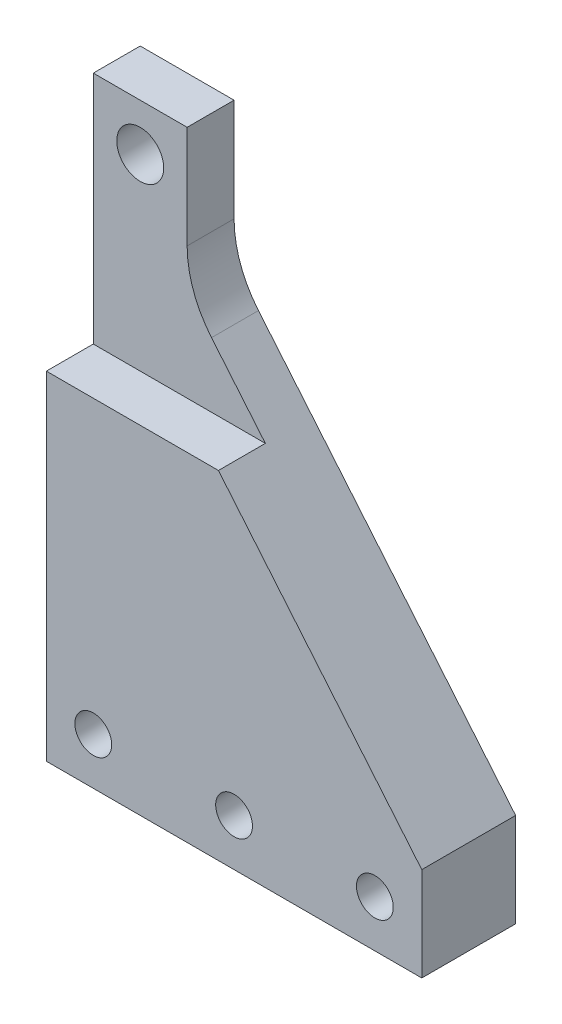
ISO-10303-21;
HEADER;
FILE_DESCRIPTION(('STEP AP214'),'2;1');
FILE_NAME('part.step','',(''),(''),'','','');
FILE_SCHEMA(('AUTOMOTIVE_DESIGN { 1 0 10303 214 1 1 1 1 }'));
ENDSEC;
DATA;
#1=APPLICATION_CONTEXT('core data for automotive mechanical design processes');
#2=APPLICATION_PROTOCOL_DEFINITION('international standard','automotive_design',2000,#1);
#3=PRODUCT_CONTEXT('',#1,'mechanical');
#4=PRODUCT('Part','Part','',(#3));
#5=PRODUCT_RELATED_PRODUCT_CATEGORY('part','',(#4));
#6=PRODUCT_DEFINITION_FORMATION('','',#4);
#7=PRODUCT_DEFINITION_CONTEXT('part definition',#1,'design');
#8=PRODUCT_DEFINITION('design','',#6,#7);
#9=PRODUCT_DEFINITION_SHAPE('','',#8);
#10=(LENGTH_UNIT() NAMED_UNIT(*) SI_UNIT(.MILLI.,.METRE.));
#11=(NAMED_UNIT(*) PLANE_ANGLE_UNIT() SI_UNIT($,.RADIAN.));
#12=(NAMED_UNIT(*) SI_UNIT($,.STERADIAN.) SOLID_ANGLE_UNIT());
#13=UNCERTAINTY_MEASURE_WITH_UNIT(LENGTH_MEASURE(1.E-05),#10,'distance_accuracy_value','');
#14=(GEOMETRIC_REPRESENTATION_CONTEXT(3) GLOBAL_UNCERTAINTY_ASSIGNED_CONTEXT((#13)) GLOBAL_UNIT_ASSIGNED_CONTEXT((#10,
#11,#12)) REPRESENTATION_CONTEXT('',''));
#15=CARTESIAN_POINT('',(0.,0.,0.));
#16=DIRECTION('',(0.,0.,1.));
#17=DIRECTION('',(1.,0.,0.));
#18=AXIS2_PLACEMENT_3D('',#15,#16,#17);
#19=CARTESIAN_POINT('',(-6.35,71.12,-12.7));
#20=DIRECTION('',(0.,-1.,0.));
#21=DIRECTION('',(0.,0.,1.));
#22=AXIS2_PLACEMENT_3D('',#19,#20,#21);
#23=PLANE('',#22);
#24=DIRECTION('',(1.,0.,0.));
#25=VECTOR('',#24,1.);
#26=CARTESIAN_POINT('',(0.,71.12,-6.35));
#27=LINE('',#26,#25);
#28=CARTESIAN_POINT('',(-6.35,71.12,-6.35));
#29=VERTEX_POINT('',#28);
#30=CARTESIAN_POINT('',(6.35,71.12,-6.35));
#31=VERTEX_POINT('',#30);
#32=EDGE_CURVE('E122',#29,#31,#27,.T.);
#33=ORIENTED_EDGE('',*,*,#32,.T.);
#34=DIRECTION('',(0.,0.,-1.));
#35=VECTOR('',#34,1.);
#36=CARTESIAN_POINT('',(6.35,71.12,0.));
#37=LINE('',#36,#35);
#38=CARTESIAN_POINT('',(6.35,71.12,-12.7));
#39=VERTEX_POINT('',#38);
#40=EDGE_CURVE('E150',#31,#39,#37,.T.);
#41=ORIENTED_EDGE('',*,*,#40,.T.);
#42=DIRECTION('',(-1.,0.,0.));
#43=VECTOR('',#42,1.);
#44=CARTESIAN_POINT('',(-6.35,71.12,-12.7));
#45=LINE('',#44,#43);
#46=CARTESIAN_POINT('',(-6.35,71.12,-12.7));
#47=VERTEX_POINT('',#46);
#48=EDGE_CURVE('E186',#39,#47,#45,.T.);
#49=ORIENTED_EDGE('',*,*,#48,.T.);
#50=DIRECTION('',(0.,0.,1.));
#51=VECTOR('',#50,1.);
#52=CARTESIAN_POINT('',(-6.35,71.12,-12.7));
#53=LINE('',#52,#51);
#54=EDGE_CURVE('E189',#47,#29,#53,.T.);
#55=ORIENTED_EDGE('',*,*,#54,.T.);
#56=EDGE_LOOP('',(#33,#41,#49,#55));
#57=FACE_BOUND('',#56,.T.);
#58=ADVANCED_FACE('F37',(#57),#23,.F.);
#59=CARTESIAN_POINT('',(0.,64.77,-12.7));
#60=DIRECTION('',(0.,0.,1.));
#61=DIRECTION('',(-1.,0.,0.));
#62=AXIS2_PLACEMENT_3D('',#59,#60,#61);
#63=CYLINDRICAL_SURFACE('',#62,3.175);
#64=CARTESIAN_POINT('',(0.,64.77,-12.7));
#65=DIRECTION('',(0.,0.,1.));
#66=DIRECTION('',(1.,0.,0.));
#67=AXIS2_PLACEMENT_3D('',#64,#65,#66);
#68=CIRCLE('',#67,3.175);
#69=CARTESIAN_POINT('',(3.175,64.77,-12.7));
#70=VERTEX_POINT('',#69);
#71=EDGE_CURVE('E153',#70,#70,#68,.T.);
#72=ORIENTED_EDGE('',*,*,#71,.F.);
#73=EDGE_LOOP('',(#72));
#74=FACE_BOUND('',#73,.T.);
#75=CARTESIAN_POINT('',(0.,64.77,-6.35));
#76=DIRECTION('',(0.,0.,-1.));
#77=DIRECTION('',(-1.,0.,0.));
#78=AXIS2_PLACEMENT_3D('',#75,#76,#77);
#79=CIRCLE('',#78,3.175);
#80=CARTESIAN_POINT('',(-3.175,64.77,-6.35));
#81=VERTEX_POINT('',#80);
#82=EDGE_CURVE('E137',#81,#81,#79,.T.);
#83=ORIENTED_EDGE('',*,*,#82,.F.);
#84=EDGE_LOOP('',(#83));
#85=FACE_BOUND('',#84,.T.);
#86=ADVANCED_FACE('F237',(#74,#85),#63,.F.);
#87=CARTESIAN_POINT('',(6.35,52.07,0.));
#88=DIRECTION('',(-1.,0.,0.));
#89=DIRECTION('',(0.,0.,-1.));
#90=AXIS2_PLACEMENT_3D('',#87,#88,#89);
#91=PLANE('',#90);
#92=DIRECTION('',(0.,-1.,0.));
#93=VECTOR('',#92,1.);
#94=CARTESIAN_POINT('',(6.35,52.07,-12.7));
#95=LINE('',#94,#93);
#96=CARTESIAN_POINT('',(6.35,57.2197982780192,-12.7));
#97=VERTEX_POINT('',#96);
#98=EDGE_CURVE('E141',#39,#97,#95,.T.);
#99=ORIENTED_EDGE('',*,*,#98,.F.);
#100=ORIENTED_EDGE('',*,*,#40,.F.);
#101=DIRECTION('',(0.,-1.,0.));
#102=VECTOR('',#101,1.);
#103=CARTESIAN_POINT('',(6.35,0.,-6.35));
#104=LINE('',#103,#102);
#105=CARTESIAN_POINT('',(6.35,57.2197982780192,-6.35));
#106=VERTEX_POINT('',#105);
#107=EDGE_CURVE('E128',#31,#106,#104,.T.);
#108=ORIENTED_EDGE('',*,*,#107,.T.);
#109=DIRECTION('',(0.,0.,-1.));
#110=VECTOR('',#109,1.);
#111=CARTESIAN_POINT('',(6.35,57.2197982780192,-6.35));
#112=LINE('',#111,#110);
#113=EDGE_CURVE('E204',#97,#106,#112,.F.);
#114=ORIENTED_EDGE('',*,*,#113,.F.);
#115=EDGE_LOOP('',(#99,#100,#108,#114));
#116=FACE_BOUND('',#115,.T.);
#117=ADVANCED_FACE('F207',(#116),#91,.F.);
#118=CARTESIAN_POINT('',(0.,0.,-12.7));
#119=DIRECTION('',(0.,0.,1.));
#120=DIRECTION('',(-1.,0.,0.));
#121=AXIS2_PLACEMENT_3D('',#118,#119,#120);
#122=PLANE('',#121);
#123=DIRECTION('',(0.64018439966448,-0.768221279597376,0.));
#124=VECTOR('',#123,1.);
#125=CARTESIAN_POINT('',(44.45,6.35,-12.7));
#126=LINE('',#125,#124);
#127=CARTESIAN_POINT('',(9.64682051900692,48.1138153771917,-12.7));
#128=VERTEX_POINT('',#127);
#129=CARTESIAN_POINT('',(44.45,6.35,-12.7));
#130=VERTEX_POINT('',#129);
#131=EDGE_CURVE('E145',#128,#130,#126,.T.);
#132=ORIENTED_EDGE('',*,*,#131,.T.);
#133=DIRECTION('',(0.,1.,0.));
#134=VECTOR('',#133,1.);
#135=CARTESIAN_POINT('',(44.45,-6.35,-12.7));
#136=LINE('',#135,#134);
#137=CARTESIAN_POINT('',(44.45,-6.35,-12.7));
#138=VERTEX_POINT('',#137);
#139=EDGE_CURVE('E183',#138,#130,#136,.T.);
#140=ORIENTED_EDGE('',*,*,#139,.F.);
#141=DIRECTION('',(1.,0.,0.));
#142=VECTOR('',#141,1.);
#143=CARTESIAN_POINT('',(-6.35,-6.35,-12.7));
#144=LINE('',#143,#142);
#145=CARTESIAN_POINT('',(-6.35,-6.35,-12.7));
#146=VERTEX_POINT('',#145);
#147=EDGE_CURVE('E179',#146,#138,#144,.T.);
#148=ORIENTED_EDGE('',*,*,#147,.F.);
#149=DIRECTION('',(0.,-1.,0.));
#150=VECTOR('',#149,1.);
#151=CARTESIAN_POINT('',(-6.35,-6.35,-12.7));
#152=LINE('',#151,#150);
#153=EDGE_CURVE('E176',#47,#146,#152,.T.);
#154=ORIENTED_EDGE('',*,*,#153,.F.);
#155=ORIENTED_EDGE('',*,*,#48,.F.);
#156=ORIENTED_EDGE('',*,*,#98,.T.);
#157=CARTESIAN_POINT('',(20.574,57.2197982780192,-12.7));
#158=DIRECTION('',(0.,0.,-1.));
#159=DIRECTION('',(-1.,0.,0.));
#160=AXIS2_PLACEMENT_3D('',#157,#158,#159);
#161=CIRCLE('',#160,14.224);
#162=EDGE_CURVE('E45',#128,#97,#161,.T.);
#163=ORIENTED_EDGE('',*,*,#162,.F.);
#164=EDGE_LOOP('',(#132,#140,#148,#154,#155,#156,#163));
#165=FACE_BOUND('',#164,.T.);
#166=CARTESIAN_POINT('',(0.,0.,-12.7));
#167=DIRECTION('',(0.,0.,1.));
#168=DIRECTION('',(1.,0.,0.));
#169=AXIS2_PLACEMENT_3D('',#166,#167,#168);
#170=CIRCLE('',#169,2.4892);
#171=CARTESIAN_POINT('',(2.4892,0.,-12.7));
#172=VERTEX_POINT('',#171);
#173=EDGE_CURVE('E170',#172,#172,#170,.T.);
#174=ORIENTED_EDGE('',*,*,#173,.T.);
#175=EDGE_LOOP('',(#174));
#176=FACE_BOUND('',#175,.T.);
#177=CARTESIAN_POINT('',(38.1,0.,-12.7));
#178=DIRECTION('',(0.,0.,1.));
#179=DIRECTION('',(1.,0.,0.));
#180=AXIS2_PLACEMENT_3D('',#177,#178,#179);
#181=CIRCLE('',#180,2.4892);
#182=CARTESIAN_POINT('',(40.5892,0.,-12.7));
#183=VERTEX_POINT('',#182);
#184=EDGE_CURVE('E164',#183,#183,#181,.T.);
#185=ORIENTED_EDGE('',*,*,#184,.T.);
#186=EDGE_LOOP('',(#185));
#187=FACE_BOUND('',#186,.T.);
#188=CARTESIAN_POINT('',(19.05,0.,-12.7));
#189=DIRECTION('',(0.,0.,1.));
#190=DIRECTION('',(1.,0.,0.));
#191=AXIS2_PLACEMENT_3D('',#188,#189,#190);
#192=CIRCLE('',#191,2.4892);
#193=CARTESIAN_POINT('',(21.5392,0.,-12.7));
#194=VERTEX_POINT('',#193);
#195=EDGE_CURVE('E158',#194,#194,#192,.T.);
#196=ORIENTED_EDGE('',*,*,#195,.T.);
#197=EDGE_LOOP('',(#196));
#198=FACE_BOUND('',#197,.T.);
#199=ORIENTED_EDGE('',*,*,#71,.T.);
#200=EDGE_LOOP('',(#199));
#201=FACE_BOUND('',#200,.T.);
#202=ADVANCED_FACE('F224',(#165,#176,#187,#198,#201),#122,.F.);
#203=CARTESIAN_POINT('',(0.,0.,0.));
#204=DIRECTION('',(0.,0.,1.));
#205=DIRECTION('',(-1.,0.,0.));
#206=AXIS2_PLACEMENT_3D('',#203,#204,#205);
#207=PLANE('',#206);
#208=DIRECTION('',(-1.,0.,0.));
#209=VECTOR('',#208,1.);
#210=CARTESIAN_POINT('',(0.,39.37,0.));
#211=LINE('',#210,#209);
#212=CARTESIAN_POINT('',(16.9333333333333,39.37,0.));
#213=VERTEX_POINT('',#212);
#214=CARTESIAN_POINT('',(-6.35,39.37,0.));
#215=VERTEX_POINT('',#214);
#216=EDGE_CURVE('E117',#213,#215,#211,.T.);
#217=ORIENTED_EDGE('',*,*,#216,.T.);
#218=DIRECTION('',(0.,-1.,0.));
#219=VECTOR('',#218,1.);
#220=CARTESIAN_POINT('',(-6.35,-6.35,0.));
#221=LINE('',#220,#219);
#222=CARTESIAN_POINT('',(-6.35,-6.35,0.));
#223=VERTEX_POINT('',#222);
#224=EDGE_CURVE('E173',#215,#223,#221,.T.);
#225=ORIENTED_EDGE('',*,*,#224,.T.);
#226=DIRECTION('',(1.,0.,0.));
#227=VECTOR('',#226,1.);
#228=CARTESIAN_POINT('',(-6.35,-6.35,0.));
#229=LINE('',#228,#227);
#230=CARTESIAN_POINT('',(44.45,-6.35,0.));
#231=VERTEX_POINT('',#230);
#232=EDGE_CURVE('E192',#223,#231,#229,.T.);
#233=ORIENTED_EDGE('',*,*,#232,.T.);
#234=DIRECTION('',(0.,1.,0.));
#235=VECTOR('',#234,1.);
#236=CARTESIAN_POINT('',(44.45,-6.35,0.));
#237=LINE('',#236,#235);
#238=CARTESIAN_POINT('',(44.45,6.35,0.));
#239=VERTEX_POINT('',#238);
#240=EDGE_CURVE('E180',#231,#239,#237,.T.);
#241=ORIENTED_EDGE('',*,*,#240,.T.);
#242=DIRECTION('',(0.64018439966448,-0.768221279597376,0.));
#243=VECTOR('',#242,1.);
#244=CARTESIAN_POINT('',(44.45,6.35,0.));
#245=LINE('',#244,#243);
#246=EDGE_CURVE('E142',#213,#239,#245,.T.);
#247=ORIENTED_EDGE('',*,*,#246,.F.);
#248=EDGE_LOOP('',(#217,#225,#233,#241,#247));
#249=FACE_BOUND('',#248,.T.);
#250=CARTESIAN_POINT('',(19.05,0.,0.));
#251=DIRECTION('',(0.,0.,1.));
#252=DIRECTION('',(1.,0.,0.));
#253=AXIS2_PLACEMENT_3D('',#250,#251,#252);
#254=CIRCLE('',#253,2.4892);
#255=CARTESIAN_POINT('',(21.5392,0.,0.));
#256=VERTEX_POINT('',#255);
#257=EDGE_CURVE('E157',#256,#256,#254,.T.);
#258=ORIENTED_EDGE('',*,*,#257,.F.);
#259=EDGE_LOOP('',(#258));
#260=FACE_BOUND('',#259,.T.);
#261=CARTESIAN_POINT('',(0.,0.,0.));
#262=DIRECTION('',(0.,0.,1.));
#263=DIRECTION('',(1.,0.,0.));
#264=AXIS2_PLACEMENT_3D('',#261,#262,#263);
#265=CIRCLE('',#264,2.4892);
#266=CARTESIAN_POINT('',(2.4892,0.,0.));
#267=VERTEX_POINT('',#266);
#268=EDGE_CURVE('E167',#267,#267,#265,.T.);
#269=ORIENTED_EDGE('',*,*,#268,.F.);
#270=EDGE_LOOP('',(#269));
#271=FACE_BOUND('',#270,.T.);
#272=CARTESIAN_POINT('',(38.1,0.,0.));
#273=DIRECTION('',(0.,0.,1.));
#274=DIRECTION('',(1.,0.,0.));
#275=AXIS2_PLACEMENT_3D('',#272,#273,#274);
#276=CIRCLE('',#275,2.4892);
#277=CARTESIAN_POINT('',(40.5892,0.,0.));
#278=VERTEX_POINT('',#277);
#279=EDGE_CURVE('E161',#278,#278,#276,.T.);
#280=ORIENTED_EDGE('',*,*,#279,.F.);
#281=EDGE_LOOP('',(#280));
#282=FACE_BOUND('',#281,.T.);
#283=ADVANCED_FACE('F217',(#249,#260,#271,#282),#207,.T.);
#284=CARTESIAN_POINT('',(-6.35,-6.35,-12.7));
#285=DIRECTION('',(1.,0.,0.));
#286=DIRECTION('',(0.,1.,0.));
#287=AXIS2_PLACEMENT_3D('',#284,#285,#286);
#288=PLANE('',#287);
#289=DIRECTION('',(0.,1.,0.));
#290=VECTOR('',#289,1.);
#291=CARTESIAN_POINT('',(-6.35,0.,-6.35));
#292=LINE('',#291,#290);
#293=CARTESIAN_POINT('',(-6.35,39.37,-6.35));
#294=VERTEX_POINT('',#293);
#295=EDGE_CURVE('E109',#294,#29,#292,.T.);
#296=ORIENTED_EDGE('',*,*,#295,.T.);
#297=ORIENTED_EDGE('',*,*,#54,.F.);
#298=ORIENTED_EDGE('',*,*,#153,.T.);
#299=DIRECTION('',(0.,0.,1.));
#300=VECTOR('',#299,1.);
#301=CARTESIAN_POINT('',(-6.35,-6.35,-12.7));
#302=LINE('',#301,#300);
#303=EDGE_CURVE('E201',#146,#223,#302,.T.);
#304=ORIENTED_EDGE('',*,*,#303,.T.);
#305=ORIENTED_EDGE('',*,*,#224,.F.);
#306=DIRECTION('',(0.,0.,1.));
#307=VECTOR('',#306,1.);
#308=CARTESIAN_POINT('',(-6.35,39.37,-6.35));
#309=LINE('',#308,#307);
#310=EDGE_CURVE('E121',#294,#215,#309,.T.);
#311=ORIENTED_EDGE('',*,*,#310,.F.);
#312=EDGE_LOOP('',(#296,#297,#298,#304,#305,#311));
#313=FACE_BOUND('',#312,.T.);
#314=ADVANCED_FACE('F212',(#313),#288,.F.);
#315=CARTESIAN_POINT('',(-6.35,-6.35,-12.7));
#316=DIRECTION('',(0.,1.,0.));
#317=DIRECTION('',(0.,0.,-1.));
#318=AXIS2_PLACEMENT_3D('',#315,#316,#317);
#319=PLANE('',#318);
#320=ORIENTED_EDGE('',*,*,#232,.F.);
#321=ORIENTED_EDGE('',*,*,#303,.F.);
#322=ORIENTED_EDGE('',*,*,#147,.T.);
#323=DIRECTION('',(0.,0.,1.));
#324=VECTOR('',#323,1.);
#325=CARTESIAN_POINT('',(44.45,-6.35,-12.7));
#326=LINE('',#325,#324);
#327=EDGE_CURVE('E199',#138,#231,#326,.T.);
#328=ORIENTED_EDGE('',*,*,#327,.T.);
#329=EDGE_LOOP('',(#320,#321,#322,#328));
#330=FACE_BOUND('',#329,.T.);
#331=ADVANCED_FACE('F227',(#330),#319,.F.);
#332=CARTESIAN_POINT('',(44.45,-6.35,-12.7));
#333=DIRECTION('',(-1.,0.,0.));
#334=DIRECTION('',(0.,0.,-1.));
#335=AXIS2_PLACEMENT_3D('',#332,#333,#334);
#336=PLANE('',#335);
#337=ORIENTED_EDGE('',*,*,#240,.F.);
#338=ORIENTED_EDGE('',*,*,#327,.F.);
#339=ORIENTED_EDGE('',*,*,#139,.T.);
#340=DIRECTION('',(0.,0.,-1.));
#341=VECTOR('',#340,1.);
#342=CARTESIAN_POINT('',(44.45,6.35,0.));
#343=LINE('',#342,#341);
#344=EDGE_CURVE('E144',#239,#130,#343,.T.);
#345=ORIENTED_EDGE('',*,*,#344,.F.);
#346=EDGE_LOOP('',(#337,#338,#339,#345));
#347=FACE_BOUND('',#346,.T.);
#348=ADVANCED_FACE('F222',(#347),#336,.F.);
#349=CARTESIAN_POINT('',(0.,0.,-12.7));
#350=DIRECTION('',(0.,0.,1.));
#351=DIRECTION('',(-1.,0.,0.));
#352=AXIS2_PLACEMENT_3D('',#349,#350,#351);
#353=CYLINDRICAL_SURFACE('',#352,2.4892);
#354=ORIENTED_EDGE('',*,*,#173,.F.);
#355=EDGE_LOOP('',(#354));
#356=FACE_BOUND('',#355,.T.);
#357=ORIENTED_EDGE('',*,*,#268,.T.);
#358=EDGE_LOOP('',(#357));
#359=FACE_BOUND('',#358,.T.);
#360=ADVANCED_FACE('F234',(#356,#359),#353,.F.);
#361=CARTESIAN_POINT('',(38.1,0.,-12.7));
#362=DIRECTION('',(0.,0.,1.));
#363=DIRECTION('',(-1.,0.,0.));
#364=AXIS2_PLACEMENT_3D('',#361,#362,#363);
#365=CYLINDRICAL_SURFACE('',#364,2.4892);
#366=ORIENTED_EDGE('',*,*,#184,.F.);
#367=EDGE_LOOP('',(#366));
#368=FACE_BOUND('',#367,.T.);
#369=ORIENTED_EDGE('',*,*,#279,.T.);
#370=EDGE_LOOP('',(#369));
#371=FACE_BOUND('',#370,.T.);
#372=ADVANCED_FACE('F251',(#368,#371),#365,.F.);
#373=CARTESIAN_POINT('',(19.05,0.,-12.7));
#374=DIRECTION('',(0.,0.,1.));
#375=DIRECTION('',(-1.,0.,0.));
#376=AXIS2_PLACEMENT_3D('',#373,#374,#375);
#377=CYLINDRICAL_SURFACE('',#376,2.4892);
#378=ORIENTED_EDGE('',*,*,#195,.F.);
#379=EDGE_LOOP('',(#378));
#380=FACE_BOUND('',#379,.T.);
#381=ORIENTED_EDGE('',*,*,#257,.T.);
#382=EDGE_LOOP('',(#381));
#383=FACE_BOUND('',#382,.T.);
#384=ADVANCED_FACE('F255',(#380,#383),#377,.F.);
#385=CARTESIAN_POINT('',(44.45,6.35,0.));
#386=DIRECTION('',(-0.768221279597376,-0.64018439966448,0.));
#387=DIRECTION('',(0.64018439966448,-0.768221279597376,0.));
#388=AXIS2_PLACEMENT_3D('',#385,#386,#387);
#389=PLANE('',#388);
#390=DIRECTION('',(0.64018439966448,-0.768221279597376,0.));
#391=VECTOR('',#390,1.);
#392=CARTESIAN_POINT('',(29.355737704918,24.4631147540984,-6.35));
#393=LINE('',#392,#391);
#394=CARTESIAN_POINT('',(9.64682051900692,48.1138153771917,-6.35));
#395=VERTEX_POINT('',#394);
#396=CARTESIAN_POINT('',(16.9333333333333,39.37,-6.35));
#397=VERTEX_POINT('',#396);
#398=EDGE_CURVE('E107',#395,#397,#393,.T.);
#399=ORIENTED_EDGE('',*,*,#398,.T.);
#400=DIRECTION('',(0.,0.,1.));
#401=VECTOR('',#400,1.);
#402=CARTESIAN_POINT('',(16.9333333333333,39.37,-6.35));
#403=LINE('',#402,#401);
#404=EDGE_CURVE('E114',#397,#213,#403,.T.);
#405=ORIENTED_EDGE('',*,*,#404,.T.);
#406=ORIENTED_EDGE('',*,*,#246,.T.);
#407=ORIENTED_EDGE('',*,*,#344,.T.);
#408=ORIENTED_EDGE('',*,*,#131,.F.);
#409=DIRECTION('',(0.,0.,-1.));
#410=VECTOR('',#409,1.);
#411=CARTESIAN_POINT('',(9.64682051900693,48.1138153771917,-12.7));
#412=LINE('',#411,#410);
#413=EDGE_CURVE('E127',#395,#128,#412,.T.);
#414=ORIENTED_EDGE('',*,*,#413,.F.);
#415=EDGE_LOOP('',(#399,#405,#406,#407,#408,#414));
#416=FACE_BOUND('',#415,.T.);
#417=ADVANCED_FACE('F125',(#416),#389,.F.);
#418=CARTESIAN_POINT('',(0.,39.37,-6.35));
#419=DIRECTION('',(0.,-1.,0.));
#420=DIRECTION('',(0.,0.,1.));
#421=AXIS2_PLACEMENT_3D('',#418,#419,#420);
#422=PLANE('',#421);
#423=ORIENTED_EDGE('',*,*,#216,.F.);
#424=ORIENTED_EDGE('',*,*,#404,.F.);
#425=DIRECTION('',(-1.,0.,0.));
#426=VECTOR('',#425,1.);
#427=CARTESIAN_POINT('',(0.,39.37,-6.35));
#428=LINE('',#427,#426);
#429=EDGE_CURVE('E103',#397,#294,#428,.T.);
#430=ORIENTED_EDGE('',*,*,#429,.T.);
#431=ORIENTED_EDGE('',*,*,#310,.T.);
#432=EDGE_LOOP('',(#423,#424,#430,#431));
#433=FACE_BOUND('',#432,.T.);
#434=ADVANCED_FACE('F115',(#433),#422,.F.);
#435=CARTESIAN_POINT('',(0.,0.,-6.35));
#436=DIRECTION('',(0.,0.,1.));
#437=DIRECTION('',(-1.,0.,0.));
#438=AXIS2_PLACEMENT_3D('',#435,#436,#437);
#439=PLANE('',#438);
#440=ORIENTED_EDGE('',*,*,#82,.T.);
#441=EDGE_LOOP('',(#440));
#442=FACE_BOUND('',#441,.T.);
#443=ORIENTED_EDGE('',*,*,#107,.F.);
#444=ORIENTED_EDGE('',*,*,#32,.F.);
#445=ORIENTED_EDGE('',*,*,#295,.F.);
#446=ORIENTED_EDGE('',*,*,#429,.F.);
#447=ORIENTED_EDGE('',*,*,#398,.F.);
#448=CARTESIAN_POINT('',(20.574,57.2197982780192,-6.35));
#449=DIRECTION('',(0.,0.,-1.));
#450=DIRECTION('',(-1.,0.,0.));
#451=AXIS2_PLACEMENT_3D('',#448,#449,#450);
#452=CIRCLE('',#451,14.224);
#453=EDGE_CURVE('E11',#106,#395,#452,.F.);
#454=ORIENTED_EDGE('',*,*,#453,.F.);
#455=EDGE_LOOP('',(#443,#444,#445,#446,#447,#454));
#456=FACE_BOUND('',#455,.T.);
#457=ADVANCED_FACE('F105',(#442,#456),#439,.T.);
#458=CARTESIAN_POINT('',(20.574,57.2197982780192,0.));
#459=DIRECTION('',(0.,0.,1.));
#460=DIRECTION('',(-1.,0.,0.));
#461=AXIS2_PLACEMENT_3D('',#458,#459,#460);
#462=CYLINDRICAL_SURFACE('',#461,14.224);
#463=ORIENTED_EDGE('',*,*,#453,.T.);
#464=ORIENTED_EDGE('',*,*,#413,.T.);
#465=ORIENTED_EDGE('',*,*,#162,.T.);
#466=ORIENTED_EDGE('',*,*,#113,.T.);
#467=EDGE_LOOP('',(#463,#464,#465,#466));
#468=FACE_BOUND('',#467,.T.);
#469=ADVANCED_FACE('F39',(#468),#462,.F.);
#470=CLOSED_SHELL('',(#58,#86,#117,#202,#283,#314,#331,#348,#360,#372,#384,#417,#434,#457,#469));
#471=MANIFOLD_SOLID_BREP('B2',#470);
#472=ADVANCED_BREP_SHAPE_REPRESENTATION('',(#18,#471),#14);
#473=SHAPE_DEFINITION_REPRESENTATION(#9,#472);
ENDSEC;
END-ISO-10303-21;
